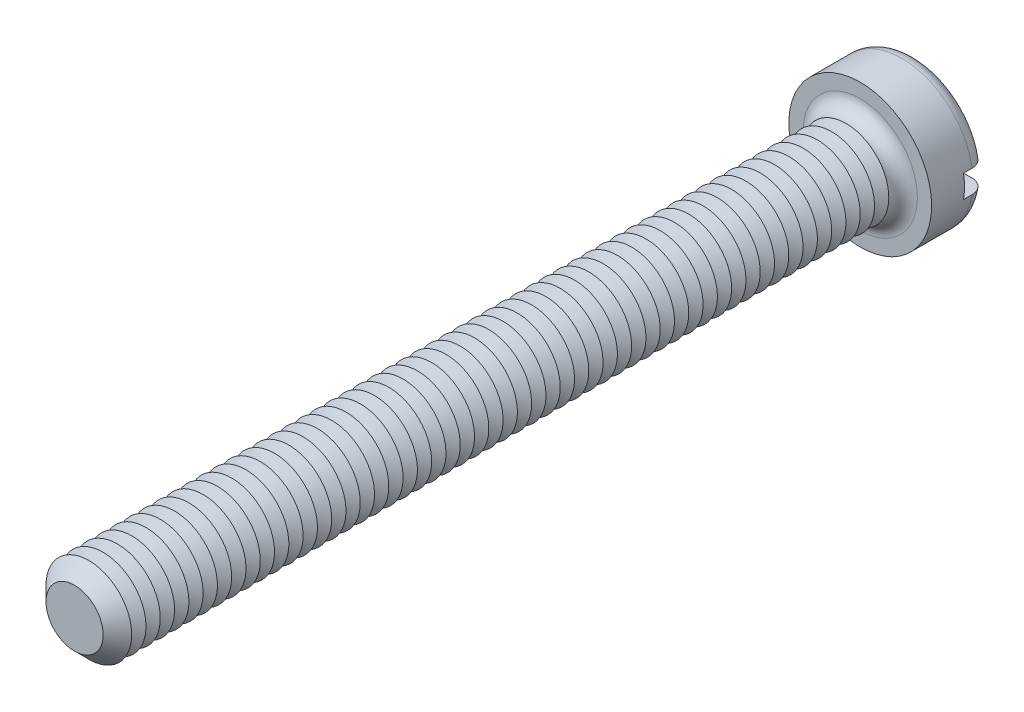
from build123d import *

# Parameters (mm, degrees)
SKETCH3_R           = 5
BOSS_EXTRUDE2_DEPTH = 3.9
SKETCH4_R           = 3
BOSS_EXTRUDE3_DEPTH = 55
FILLET1_R           = 1
CHAMFER1_SIZE       = 1
LPATTERN1_COUNT     = 53
LPATTERN1_PITCH     = 1
SKETCH8_W           = 10
SKETCH8_H           = 1.6
CUT_EXTRUDE1_DEPTH  = 1.6


with BuildPart() as part:
    # Sketch3 → Boss-Extrude2 (new body)
    with BuildSketch(Plane.XY):
        Circle(SKETCH3_R)
    extrude(amount=-BOSS_EXTRUDE2_DEPTH)

    # Sketch4 → Boss-Extrude3 (add)
    with BuildSketch(Plane.XY):
        Circle(SKETCH4_R)
    extrude(amount=BOSS_EXTRUDE3_DEPTH)

    # Fillet1
    fillet1_edges = [part.edges().sort_by_distance(p)[0] for p in [
        (-5, 0, -3.9),
        (-3, 0, 0),
    ]]
    fillet(fillet1_edges, radius=FILLET1_R)

    # Chamfer1
    chamfer1_edges = [part.edges().sort_by_distance(p)[0] for p in [
        (-3, 0, 55),
    ]]
    chamfer(chamfer1_edges, length=CHAMFER1_SIZE)

    # Sketch6 → Cut-Revolve1 (revolve, cut)
    with BuildSketch(Plane(origin=(0, 0, 0), x_dir=(0, 0, -1), z_dir=(1, 0, 0)), mode=Mode.PRIVATE) as cut_revolve1_sk:
        Polygon((-1, 3), (-1.5, 2.133974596), (-2, 3), align=None)
    cut_revolve1 = revolve(cut_revolve1_sk.sketch.rotate(Axis((0, 0, -1.694361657), (0, 0, 1)), 90), axis=Axis((0, 0, -1.694361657), (0, 0, 1)), mode=Mode.SUBTRACT)

    # LPattern1: Cut-Revolve1 ×53
    with Locations(*[(0, 0, i * LPATTERN1_PITCH) for i in range(1, LPATTERN1_COUNT)]):
        add(cut_revolve1, mode=Mode.SUBTRACT)

    # Sketch8 → Cut-Extrude1 (cut)
    with BuildSketch(Plane(origin=(0, 0, -3.9), x_dir=(-1, 0, 0), z_dir=(0, 0, -1))):
        Rectangle(SKETCH8_W, SKETCH8_H)
    extrude(amount=-CUT_EXTRUDE1_DEPTH, mode=Mode.SUBTRACT)


solid = part.part
